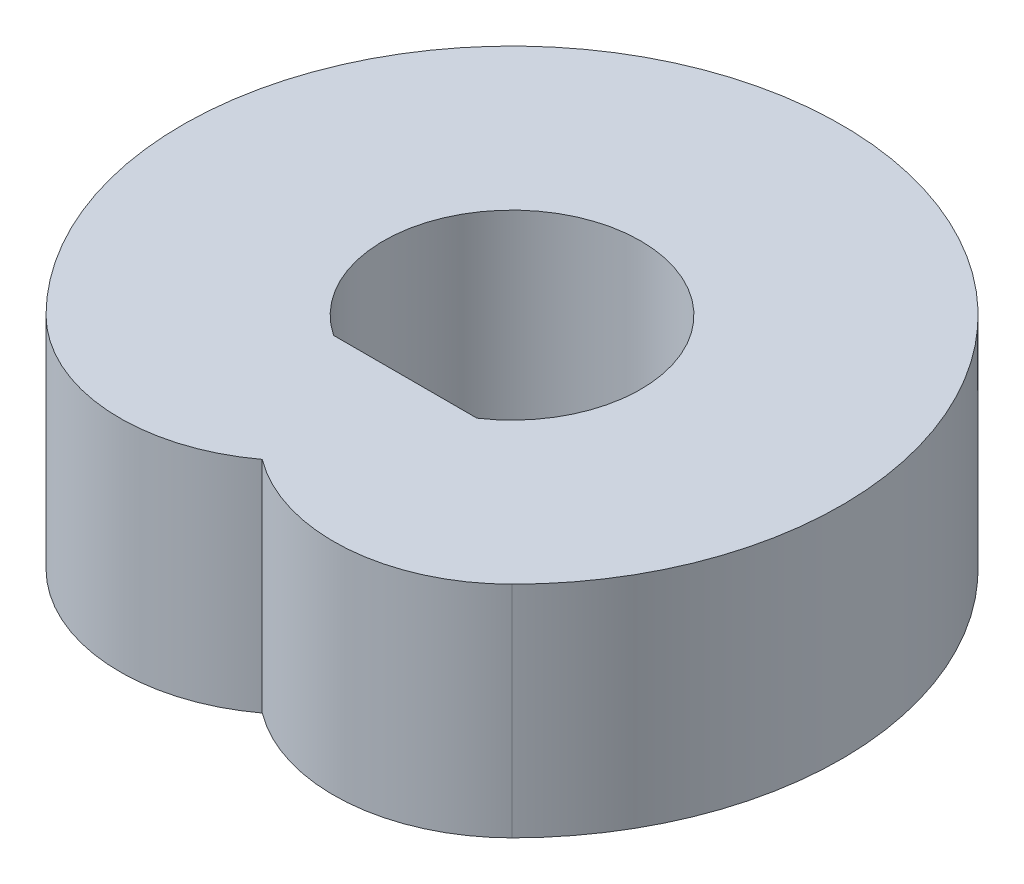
ISO-10303-21;
HEADER;
FILE_DESCRIPTION(('STEP AP214'),'2;1');
FILE_NAME('part.step','',(''),(''),'','','');
FILE_SCHEMA(('AUTOMOTIVE_DESIGN { 1 0 10303 214 1 1 1 1 }'));
ENDSEC;
DATA;
#1=APPLICATION_CONTEXT('core data for automotive mechanical design processes');
#2=APPLICATION_PROTOCOL_DEFINITION('international standard','automotive_design',2000,#1);
#3=PRODUCT_CONTEXT('',#1,'mechanical');
#4=PRODUCT('Part','Part','',(#3));
#5=PRODUCT_RELATED_PRODUCT_CATEGORY('part','',(#4));
#6=PRODUCT_DEFINITION_FORMATION('','',#4);
#7=PRODUCT_DEFINITION_CONTEXT('part definition',#1,'design');
#8=PRODUCT_DEFINITION('design','',#6,#7);
#9=PRODUCT_DEFINITION_SHAPE('','',#8);
#10=(LENGTH_UNIT() NAMED_UNIT(*) SI_UNIT(.MILLI.,.METRE.));
#11=(NAMED_UNIT(*) PLANE_ANGLE_UNIT() SI_UNIT($,.RADIAN.));
#12=(NAMED_UNIT(*) SI_UNIT($,.STERADIAN.) SOLID_ANGLE_UNIT());
#13=UNCERTAINTY_MEASURE_WITH_UNIT(LENGTH_MEASURE(1.E-05),#10,'distance_accuracy_value','');
#14=(GEOMETRIC_REPRESENTATION_CONTEXT(3) GLOBAL_UNCERTAINTY_ASSIGNED_CONTEXT((#13)) GLOBAL_UNIT_ASSIGNED_CONTEXT((#10,
#11,#12)) REPRESENTATION_CONTEXT('',''));
#15=CARTESIAN_POINT('',(0.,0.,0.));
#16=DIRECTION('',(0.,0.,1.));
#17=DIRECTION('',(1.,0.,0.));
#18=AXIS2_PLACEMENT_3D('',#15,#16,#17);
#19=CARTESIAN_POINT('',(97.2271824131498,400.,97.2271824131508));
#20=DIRECTION('',(0.,1.,0.));
#21=DIRECTION('',(0.,0.,1.));
#22=AXIS2_PLACEMENT_3D('',#19,#20,#21);
#23=PLANE('',#22);
#24=CARTESIAN_POINT('',(194.4543648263,400.,194.454364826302));
#25=DIRECTION('',(0.,1.,0.));
#26=DIRECTION('',(0.,0.,1.));
#27=AXIS2_PLACEMENT_3D('',#24,#25,#26);
#28=CIRCLE('',#27,324.999999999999);
#29=CARTESIAN_POINT('',(1.27675647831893E-12,400.,454.862698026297));
#30=VERTEX_POINT('',#29);
#31=CARTESIAN_POINT('',(424.264068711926,400.,424.264068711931));
#32=VERTEX_POINT('',#31);
#33=EDGE_CURVE('E98',#30,#32,#28,.T.);
#34=ORIENTED_EDGE('',*,*,#33,.T.);
#35=CARTESIAN_POINT('',(0.,400.,0.));
#36=DIRECTION('',(0.,1.,0.));
#37=DIRECTION('',(0.,0.,1.));
#38=AXIS2_PLACEMENT_3D('',#35,#36,#37);
#39=CIRCLE('',#38,600.);
#40=CARTESIAN_POINT('',(-424.264068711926,400.,424.264068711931));
#41=VERTEX_POINT('',#40);
#42=EDGE_CURVE('E101',#32,#41,#39,.T.);
#43=ORIENTED_EDGE('',*,*,#42,.T.);
#44=CARTESIAN_POINT('',(-194.454364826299,400.,194.454364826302));
#45=DIRECTION('',(0.,1.,0.));
#46=DIRECTION('',(0.,0.,1.));
#47=AXIS2_PLACEMENT_3D('',#44,#45,#46);
#48=CIRCLE('',#47,325.);
#49=EDGE_CURVE('E104',#41,#30,#48,.T.);
#50=ORIENTED_EDGE('',*,*,#49,.T.);
#51=EDGE_LOOP('',(#34,#43,#50));
#52=FACE_BOUND('',#51,.T.);
#53=DIRECTION('',(1.,0.,0.));
#54=VECTOR('',#53,1.);
#55=CARTESIAN_POINT('',(130.545635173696,400.,194.454364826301));
#56=LINE('',#55,#54);
#57=CARTESIAN_POINT('',(-130.545635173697,400.,194.4543648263));
#58=VERTEX_POINT('',#57);
#59=CARTESIAN_POINT('',(130.545635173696,400.,194.454364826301));
#60=VERTEX_POINT('',#59);
#61=EDGE_CURVE('E81',#58,#60,#56,.T.);
#62=ORIENTED_EDGE('',*,*,#61,.F.);
#63=CARTESIAN_POINT('',(0.,400.,0.));
#64=DIRECTION('',(0.,1.,0.));
#65=DIRECTION('',(0.,0.,1.));
#66=AXIS2_PLACEMENT_3D('',#63,#64,#65);
#67=CIRCLE('',#66,234.210723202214);
#68=EDGE_CURVE('E87',#60,#58,#67,.T.);
#69=ORIENTED_EDGE('',*,*,#68,.F.);
#70=EDGE_LOOP('',(#62,#69));
#71=FACE_BOUND('',#70,.T.);
#72=ADVANCED_FACE('F35',(#52,#71),#23,.T.);
#73=CARTESIAN_POINT('',(97.2271824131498,0.,97.2271824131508));
#74=DIRECTION('',(0.,1.,0.));
#75=DIRECTION('',(0.,0.,1.));
#76=AXIS2_PLACEMENT_3D('',#73,#74,#75);
#77=PLANE('',#76);
#78=CARTESIAN_POINT('',(194.4543648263,0.,194.454364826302));
#79=DIRECTION('',(0.,1.,0.));
#80=DIRECTION('',(0.,0.,1.));
#81=AXIS2_PLACEMENT_3D('',#78,#79,#80);
#82=CIRCLE('',#81,324.999999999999);
#83=CARTESIAN_POINT('',(1.27675647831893E-12,0.,454.862698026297));
#84=VERTEX_POINT('',#83);
#85=CARTESIAN_POINT('',(424.264068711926,0.,424.264068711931));
#86=VERTEX_POINT('',#85);
#87=EDGE_CURVE('E97',#84,#86,#82,.T.);
#88=ORIENTED_EDGE('',*,*,#87,.F.);
#89=CARTESIAN_POINT('',(-194.454364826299,0.,194.454364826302));
#90=DIRECTION('',(0.,1.,0.));
#91=DIRECTION('',(0.,0.,1.));
#92=AXIS2_PLACEMENT_3D('',#89,#90,#91);
#93=CIRCLE('',#92,325.);
#94=CARTESIAN_POINT('',(-424.264068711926,0.,424.264068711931));
#95=VERTEX_POINT('',#94);
#96=EDGE_CURVE('E102',#95,#84,#93,.T.);
#97=ORIENTED_EDGE('',*,*,#96,.F.);
#98=CARTESIAN_POINT('',(0.,0.,0.));
#99=DIRECTION('',(0.,1.,0.));
#100=DIRECTION('',(0.,0.,1.));
#101=AXIS2_PLACEMENT_3D('',#98,#99,#100);
#102=CIRCLE('',#101,600.);
#103=EDGE_CURVE('E109',#86,#95,#102,.T.);
#104=ORIENTED_EDGE('',*,*,#103,.F.);
#105=EDGE_LOOP('',(#88,#97,#104));
#106=FACE_BOUND('',#105,.T.);
#107=CARTESIAN_POINT('',(0.,0.,0.));
#108=DIRECTION('',(0.,1.,0.));
#109=DIRECTION('',(0.,0.,1.));
#110=AXIS2_PLACEMENT_3D('',#107,#108,#109);
#111=CIRCLE('',#110,234.210723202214);
#112=CARTESIAN_POINT('',(130.545635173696,0.,194.454364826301));
#113=VERTEX_POINT('',#112);
#114=CARTESIAN_POINT('',(-130.545635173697,0.,194.4543648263));
#115=VERTEX_POINT('',#114);
#116=EDGE_CURVE('E57',#113,#115,#111,.T.);
#117=ORIENTED_EDGE('',*,*,#116,.T.);
#118=DIRECTION('',(1.,0.,0.));
#119=VECTOR('',#118,1.);
#120=CARTESIAN_POINT('',(130.545635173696,0.,194.454364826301));
#121=LINE('',#120,#119);
#122=EDGE_CURVE('E91',#115,#113,#121,.T.);
#123=ORIENTED_EDGE('',*,*,#122,.T.);
#124=EDGE_LOOP('',(#117,#123));
#125=FACE_BOUND('',#124,.T.);
#126=ADVANCED_FACE('F123',(#106,#125),#77,.F.);
#127=CARTESIAN_POINT('',(194.4543648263,400.,194.454364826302));
#128=DIRECTION('',(0.,-1.,0.));
#129=DIRECTION('',(0.,0.,-1.));
#130=AXIS2_PLACEMENT_3D('',#127,#128,#129);
#131=CYLINDRICAL_SURFACE('',#130,324.999999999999);
#132=ORIENTED_EDGE('',*,*,#87,.T.);
#133=DIRECTION('',(0.,-1.,0.));
#134=VECTOR('',#133,1.);
#135=CARTESIAN_POINT('',(424.264068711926,400.,424.264068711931));
#136=LINE('',#135,#134);
#137=EDGE_CURVE('E11',#32,#86,#136,.T.);
#138=ORIENTED_EDGE('',*,*,#137,.F.);
#139=ORIENTED_EDGE('',*,*,#33,.F.);
#140=DIRECTION('',(0.,-1.,0.));
#141=VECTOR('',#140,1.);
#142=CARTESIAN_POINT('',(1.27675647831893E-12,400.,454.862698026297));
#143=LINE('',#142,#141);
#144=EDGE_CURVE('E106',#30,#84,#143,.T.);
#145=ORIENTED_EDGE('',*,*,#144,.T.);
#146=EDGE_LOOP('',(#132,#138,#139,#145));
#147=FACE_BOUND('',#146,.T.);
#148=ADVANCED_FACE('F37',(#147),#131,.T.);
#149=CARTESIAN_POINT('',(0.,400.,0.));
#150=DIRECTION('',(0.,-1.,0.));
#151=DIRECTION('',(0.,0.,-1.));
#152=AXIS2_PLACEMENT_3D('',#149,#150,#151);
#153=CYLINDRICAL_SURFACE('',#152,600.);
#154=ORIENTED_EDGE('',*,*,#103,.T.);
#155=DIRECTION('',(0.,-1.,0.));
#156=VECTOR('',#155,1.);
#157=CARTESIAN_POINT('',(-424.264068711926,400.,424.264068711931));
#158=LINE('',#157,#156);
#159=EDGE_CURVE('E43',#41,#95,#158,.T.);
#160=ORIENTED_EDGE('',*,*,#159,.F.);
#161=ORIENTED_EDGE('',*,*,#42,.F.);
#162=ORIENTED_EDGE('',*,*,#137,.T.);
#163=EDGE_LOOP('',(#154,#160,#161,#162));
#164=FACE_BOUND('',#163,.T.);
#165=ADVANCED_FACE('F129',(#164),#153,.T.);
#166=CARTESIAN_POINT('',(-194.454364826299,400.,194.454364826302));
#167=DIRECTION('',(0.,-1.,0.));
#168=DIRECTION('',(0.,0.,-1.));
#169=AXIS2_PLACEMENT_3D('',#166,#167,#168);
#170=CYLINDRICAL_SURFACE('',#169,325.);
#171=ORIENTED_EDGE('',*,*,#96,.T.);
#172=ORIENTED_EDGE('',*,*,#144,.F.);
#173=ORIENTED_EDGE('',*,*,#49,.F.);
#174=ORIENTED_EDGE('',*,*,#159,.T.);
#175=EDGE_LOOP('',(#171,#172,#173,#174));
#176=FACE_BOUND('',#175,.T.);
#177=ADVANCED_FACE('F118',(#176),#170,.T.);
#178=CARTESIAN_POINT('',(0.,400.,0.));
#179=DIRECTION('',(0.,-1.,0.));
#180=DIRECTION('',(0.,0.,-1.));
#181=AXIS2_PLACEMENT_3D('',#178,#179,#180);
#182=CYLINDRICAL_SURFACE('',#181,234.210723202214);
#183=ORIENTED_EDGE('',*,*,#116,.F.);
#184=DIRECTION('',(0.,-1.,0.));
#185=VECTOR('',#184,1.);
#186=CARTESIAN_POINT('',(130.545635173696,400.,194.454364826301));
#187=LINE('',#186,#185);
#188=EDGE_CURVE('E83',#60,#113,#187,.T.);
#189=ORIENTED_EDGE('',*,*,#188,.F.);
#190=ORIENTED_EDGE('',*,*,#68,.T.);
#191=DIRECTION('',(0.,-1.,0.));
#192=VECTOR('',#191,1.);
#193=CARTESIAN_POINT('',(-130.545635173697,400.,194.4543648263));
#194=LINE('',#193,#192);
#195=EDGE_CURVE('E50',#58,#115,#194,.T.);
#196=ORIENTED_EDGE('',*,*,#195,.T.);
#197=EDGE_LOOP('',(#183,#189,#190,#196));
#198=FACE_BOUND('',#197,.T.);
#199=ADVANCED_FACE('F89',(#198),#182,.F.);
#200=CARTESIAN_POINT('',(130.545635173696,400.,194.454364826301));
#201=DIRECTION('',(0.,0.,-1.));
#202=DIRECTION('',(-1.,0.,0.));
#203=AXIS2_PLACEMENT_3D('',#200,#201,#202);
#204=PLANE('',#203);
#205=ORIENTED_EDGE('',*,*,#122,.F.);
#206=ORIENTED_EDGE('',*,*,#195,.F.);
#207=ORIENTED_EDGE('',*,*,#61,.T.);
#208=ORIENTED_EDGE('',*,*,#188,.T.);
#209=EDGE_LOOP('',(#205,#206,#207,#208));
#210=FACE_BOUND('',#209,.T.);
#211=ADVANCED_FACE('F82',(#210),#204,.T.);
#212=CLOSED_SHELL('',(#72,#126,#148,#165,#177,#199,#211));
#213=MANIFOLD_SOLID_BREP('B2',#212);
#214=ADVANCED_BREP_SHAPE_REPRESENTATION('',(#18,#213),#14);
#215=SHAPE_DEFINITION_REPRESENTATION(#9,#214);
ENDSEC;
END-ISO-10303-21;
